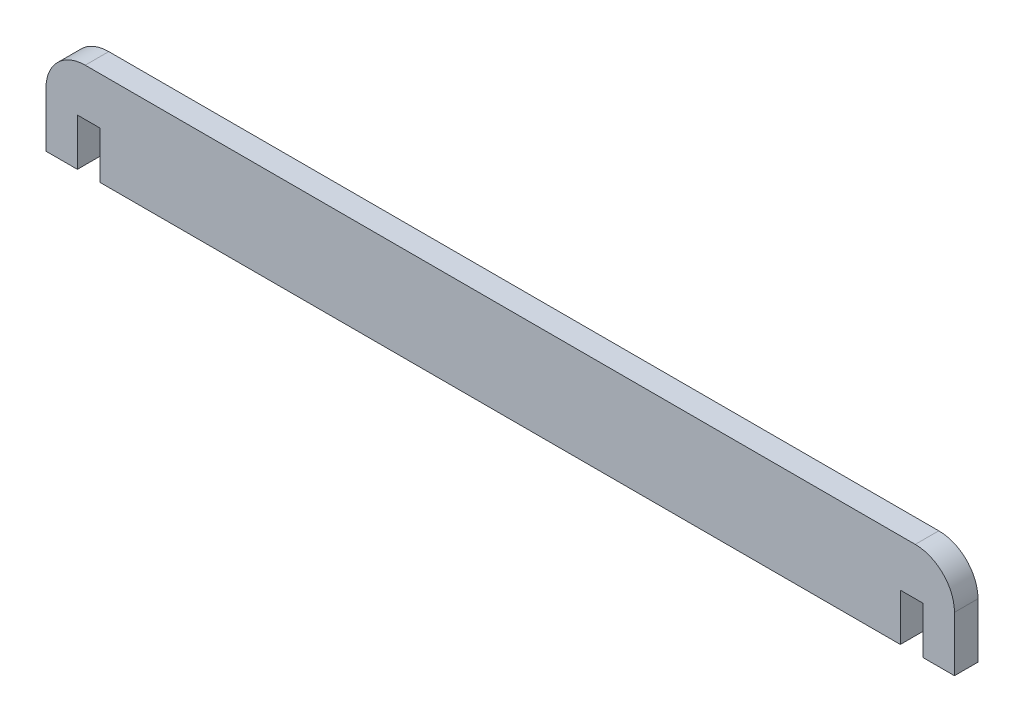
from build123d import *

# Parameters (mm, degrees)
BOSS_EXTRU_1_DEPTH = 3
CONG_1_R           = 5


with BuildPart() as part:
    # Esquisse1 → Boss.-Extru.1 (new body)
    with BuildSketch(Plane.XY):
        Polygon((0, 0), (102, 0), (102, 6), (104.9, 6), (104.9, 0), (108.9, 0), (108.9, 12), (-6.9, 12), (-6.9, 0), (-2.9, 0), (-2.9, 6), (0, 6), align=None)
    extrude(amount=BOSS_EXTRU_1_DEPTH)

    # Cong_1
    cong_1_edges = [part.edges().sort_by_distance(p)[0] for p in [
        (-6.9, 12, 1.5),
        (108.9, 12, 1.5),
    ]]
    fillet(cong_1_edges, radius=CONG_1_R)


solid = part.part
